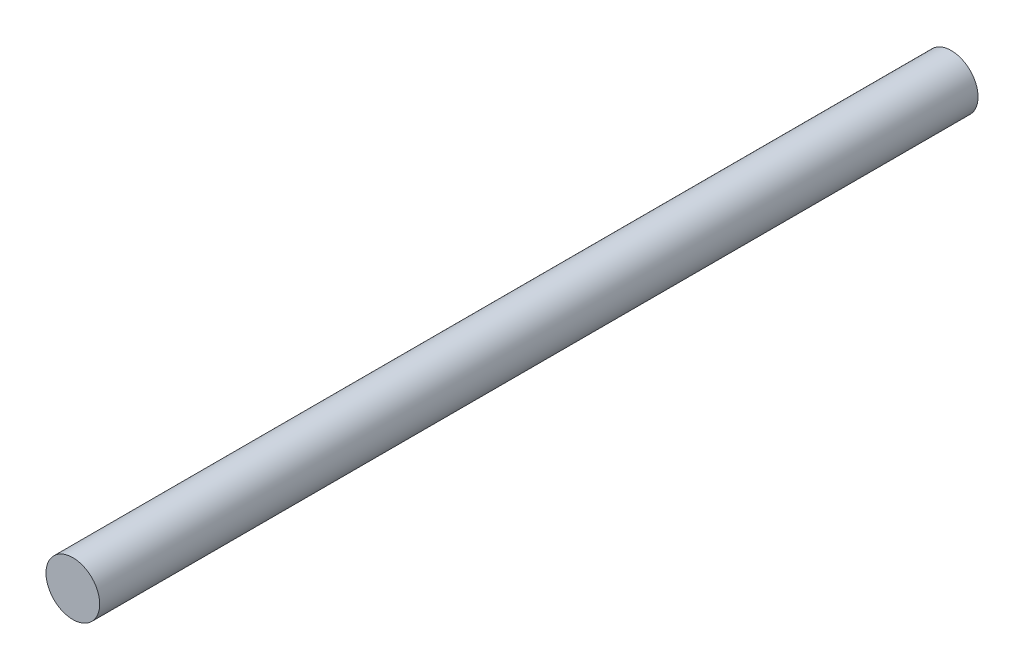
from build123d import *

# Parameters (mm, degrees)
SKETCH1_R           = 2.75
BOSS_EXTRUDE1_DEPTH = 90


with BuildPart() as part:
    # Sketch1 → Boss-Extrude1 (new body)
    with BuildSketch(Plane.XY):
        with Locations(Location((0, 0, 0), (0, 0, 180))):
            Circle(SKETCH1_R)
    extrude(amount=BOSS_EXTRUDE1_DEPTH)


solid = part.part
